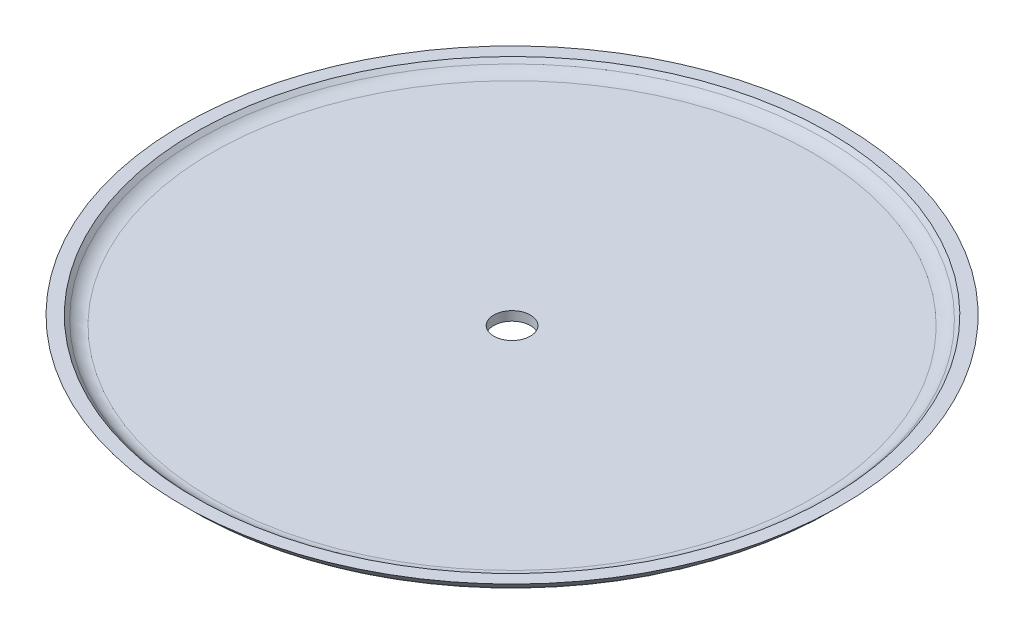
from build123d import *

# Parameters (mm, degrees)
ENL_V_MAT_EXTRU_1_REACH = 27.461
ESQUISSE2_R             = 1


with BuildPart() as part:
    # Esquisse1 → R_volution1 (revolve)
    with BuildSketch(Plane.XY, mode=Mode.PRIVATE) as r_volution1_sk:
        with BuildLine():
            Line((0, 0), (0, 0.5))
            Line((0, 0.5), (-16.378679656, 0.5))
            ThreePointArc((-16.378679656, 0.5), (-16.761363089, 0.576120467), (-17.085786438, 0.792893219))
            Line((-17.085786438, 0.792893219), (-17.292893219, 1))
            Line((-17.292893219, 1), (-18, 1))
            Line((-18, 1), (-17.439339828, 0.439339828))
            ThreePointArc((-17.439339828, 0.439339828), (-16.952704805, 0.114180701), (-16.378679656, 0))
            Line((-16.378679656, 0), (0, 0))
        make_face()
    revolve(r_volution1_sk.sketch.rotate(Axis((0, 0.5, 0), (0, 1, 0)), 270), axis=Axis((0, 0.5, 0), (0, 1, 0)))

    # Esquisse2 → Enl_v. mat.-Extru.1 (cut, up to next)
    with BuildSketch(Plane(origin=(0, 0.5, 0), x_dir=(-1, 0, 0), z_dir=(0, 1, 0)), mode=Mode.PRIVATE) as enl_v_mat_extru_1_sk1:
        with Locations(Location((0, 0, 0), (0, 0, 90))):
            Circle(ESQUISSE2_R)
    enl_v_mat_extru_1_tool1 = extrude(enl_v_mat_extru_1_sk1.sketch, amount=-ENL_V_MAT_EXTRU_1_REACH, mode=Mode.PRIVATE) & part.part
    add(enl_v_mat_extru_1_tool1.solids().sort_by_distance((0, 0.5, 0))[0], mode=Mode.SUBTRACT)


solid = part.part
